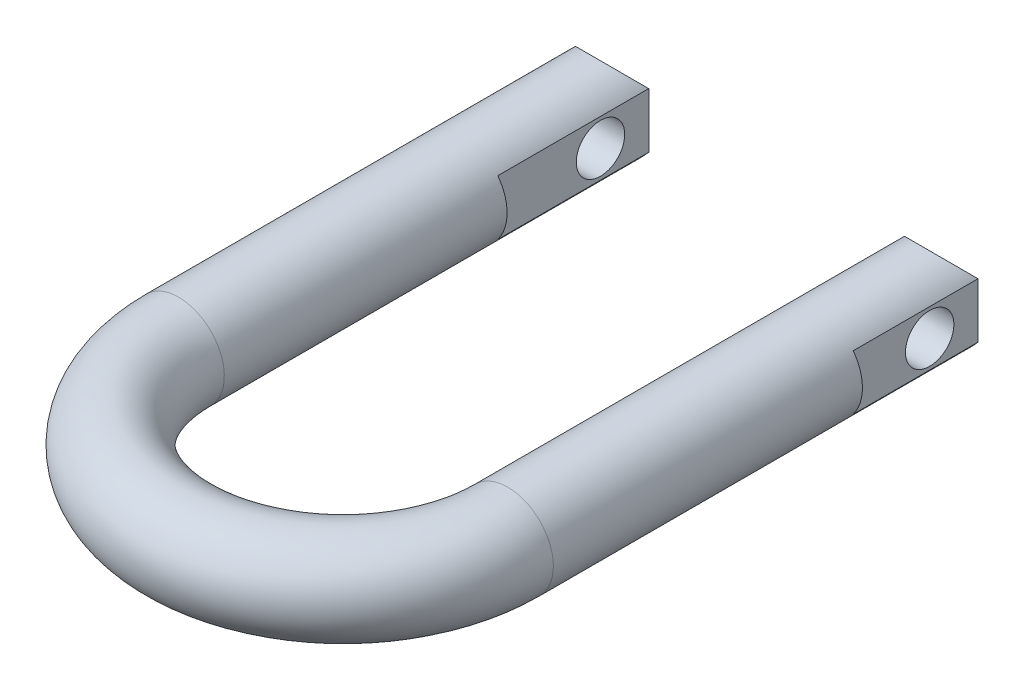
ISO-10303-21;
HEADER;
FILE_DESCRIPTION(('STEP AP214'),'2;1');
FILE_NAME('part.step','',(''),(''),'','','');
FILE_SCHEMA(('AUTOMOTIVE_DESIGN { 1 0 10303 214 1 1 1 1 }'));
ENDSEC;
DATA;
#1=APPLICATION_CONTEXT('core data for automotive mechanical design processes');
#2=APPLICATION_PROTOCOL_DEFINITION('international standard','automotive_design',2000,#1);
#3=PRODUCT_CONTEXT('',#1,'mechanical');
#4=PRODUCT('Part','Part','',(#3));
#5=PRODUCT_RELATED_PRODUCT_CATEGORY('part','',(#4));
#6=PRODUCT_DEFINITION_FORMATION('','',#4);
#7=PRODUCT_DEFINITION_CONTEXT('part definition',#1,'design');
#8=PRODUCT_DEFINITION('design','',#6,#7);
#9=PRODUCT_DEFINITION_SHAPE('','',#8);
#10=(LENGTH_UNIT() NAMED_UNIT(*) SI_UNIT(.MILLI.,.METRE.));
#11=(NAMED_UNIT(*) PLANE_ANGLE_UNIT() SI_UNIT($,.RADIAN.));
#12=(NAMED_UNIT(*) SI_UNIT($,.STERADIAN.) SOLID_ANGLE_UNIT());
#13=UNCERTAINTY_MEASURE_WITH_UNIT(LENGTH_MEASURE(1.E-05),#10,'distance_accuracy_value','');
#14=(GEOMETRIC_REPRESENTATION_CONTEXT(3) GLOBAL_UNCERTAINTY_ASSIGNED_CONTEXT((#13)) GLOBAL_UNIT_ASSIGNED_CONTEXT((#10,
#11,#12)) REPRESENTATION_CONTEXT('',''));
#15=CARTESIAN_POINT('',(0.,0.,0.));
#16=DIRECTION('',(0.,0.,1.));
#17=DIRECTION('',(1.,0.,0.));
#18=AXIS2_PLACEMENT_3D('',#15,#16,#17);
#19=CARTESIAN_POINT('',(97.3,-13.9,37.));
#20=DIRECTION('',(-1.,0.,0.));
#21=DIRECTION('',(0.,-1.,0.));
#22=AXIS2_PLACEMENT_3D('',#19,#20,#21);
#23=PLANE('',#22);
#24=DIRECTION('',(0.,0.,-1.));
#25=VECTOR('',#24,1.);
#26=CARTESIAN_POINT('',(97.3,-13.2999060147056,186.6));
#27=LINE('',#26,#25);
#28=CARTESIAN_POINT('',(97.3,-13.2999060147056,37.));
#29=VERTEX_POINT('',#28);
#30=CARTESIAN_POINT('',(97.3,-13.2999060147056,-23.4));
#31=VERTEX_POINT('',#30);
#32=EDGE_CURVE('E127',#29,#31,#27,.T.);
#33=ORIENTED_EDGE('',*,*,#32,.T.);
#34=DIRECTION('',(0.,1.,0.));
#35=VECTOR('',#34,1.);
#36=CARTESIAN_POINT('',(97.3,-13.9,-23.4));
#37=LINE('',#36,#35);
#38=CARTESIAN_POINT('',(97.3,13.2999060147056,-23.4));
#39=VERTEX_POINT('',#38);
#40=EDGE_CURVE('E141',#31,#39,#37,.T.);
#41=ORIENTED_EDGE('',*,*,#40,.T.);
#42=DIRECTION('',(0.,0.,-1.));
#43=VECTOR('',#42,1.);
#44=CARTESIAN_POINT('',(97.3,13.2999060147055,186.6));
#45=LINE('',#44,#43);
#46=CARTESIAN_POINT('',(97.3,13.2999060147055,37.));
#47=VERTEX_POINT('',#46);
#48=EDGE_CURVE('E116',#39,#47,#45,.F.);
#49=ORIENTED_EDGE('',*,*,#48,.T.);
#50=DIRECTION('',(0.,1.,0.));
#51=VECTOR('',#50,1.);
#52=CARTESIAN_POINT('',(97.3,-13.9,37.));
#53=LINE('',#52,#51);
#54=EDGE_CURVE('E147',#29,#47,#53,.T.);
#55=ORIENTED_EDGE('',*,*,#54,.F.);
#56=EDGE_LOOP('',(#33,#41,#49,#55));
#57=FACE_BOUND('',#56,.T.);
#58=CARTESIAN_POINT('',(97.3,0.,0.));
#59=DIRECTION('',(-1.,0.,0.));
#60=DIRECTION('',(0.,0.,1.));
#61=AXIS2_PLACEMENT_3D('',#58,#59,#60);
#62=CIRCLE('',#61,11.72);
#63=CARTESIAN_POINT('',(97.3,0.,11.72));
#64=VERTEX_POINT('',#63);
#65=EDGE_CURVE('E506',#64,#64,#62,.T.);
#66=ORIENTED_EDGE('',*,*,#65,.T.);
#67=EDGE_LOOP('',(#66));
#68=FACE_BOUND('',#67,.T.);
#69=ADVANCED_FACE('F14',(#57,#68),#23,.F.);
#70=CARTESIAN_POINT('',(79.65,0.,186.6));
#71=DIRECTION('',(0.,0.,-1.));
#72=DIRECTION('',(1.,0.,0.));
#73=AXIS2_PLACEMENT_3D('',#70,#71,#72);
#74=CYLINDRICAL_SURFACE('',#73,22.1);
#75=CARTESIAN_POINT('',(79.65,0.,186.6));
#76=DIRECTION('',(0.,0.,-1.));
#77=DIRECTION('',(0.,-1.,0.));
#78=AXIS2_PLACEMENT_3D('',#75,#76,#77);
#79=CIRCLE('',#78,22.1);
#80=CARTESIAN_POINT('',(101.75,0.,186.6));
#81=VERTEX_POINT('',#80);
#82=EDGE_CURVE('E157',#81,#81,#79,.T.);
#83=ORIENTED_EDGE('',*,*,#82,.T.);
#84=EDGE_LOOP('',(#83));
#85=FACE_BOUND('',#84,.T.);
#86=ORIENTED_EDGE('',*,*,#48,.F.);
#87=CARTESIAN_POINT('',(79.65,0.,-36.6999060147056));
#88=DIRECTION('',(0.,0.707106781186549,-0.707106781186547));
#89=DIRECTION('',(0.,-0.707106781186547,-0.707106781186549));
#90=AXIS2_PLACEMENT_3D('',#87,#88,#89);
#91=ELLIPSE('',#90,31.2541197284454,22.1);
#92=CARTESIAN_POINT('',(62.1,13.4315859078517,-23.2683201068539));
#93=VERTEX_POINT('',#92);
#94=EDGE_CURVE('E120',#39,#93,#91,.F.);
#95=ORIENTED_EDGE('',*,*,#94,.T.);
#96=DIRECTION('',(0.,0.,-1.));
#97=VECTOR('',#96,1.);
#98=CARTESIAN_POINT('',(62.1,13.4315859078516,186.6));
#99=LINE('',#98,#97);
#100=CARTESIAN_POINT('',(62.1,13.4315859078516,-23.4));
#101=VERTEX_POINT('',#100);
#102=EDGE_CURVE('E135',#101,#93,#99,.F.);
#103=ORIENTED_EDGE('',*,*,#102,.F.);
#104=CARTESIAN_POINT('',(79.65,0.,-23.4));
#105=DIRECTION('',(0.,0.,-1.));
#106=DIRECTION('',(0.,-1.,0.));
#107=AXIS2_PLACEMENT_3D('',#104,#105,#106);
#108=CIRCLE('',#107,22.1);
#109=CARTESIAN_POINT('',(62.05,13.3660016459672,-23.4));
#110=VERTEX_POINT('',#109);
#111=EDGE_CURVE('E126',#110,#101,#108,.T.);
#112=ORIENTED_EDGE('',*,*,#111,.F.);
#113=DIRECTION('',(0.,0.,-1.));
#114=VECTOR('',#113,1.);
#115=CARTESIAN_POINT('',(62.05,13.3660016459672,186.6));
#116=LINE('',#115,#114);
#117=CARTESIAN_POINT('',(62.05,13.3660016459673,49.7));
#118=VERTEX_POINT('',#117);
#119=EDGE_CURVE('E150',#110,#118,#116,.F.);
#120=ORIENTED_EDGE('',*,*,#119,.T.);
#121=CARTESIAN_POINT('',(79.65,0.,49.7));
#122=DIRECTION('',(0.,0.,1.));
#123=DIRECTION('',(0.,-1.,0.));
#124=AXIS2_PLACEMENT_3D('',#121,#122,#123);
#125=CIRCLE('',#124,22.1);
#126=CARTESIAN_POINT('',(62.05,-13.3660016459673,49.7));
#127=VERTEX_POINT('',#126);
#128=EDGE_CURVE('E9',#127,#118,#125,.F.);
#129=ORIENTED_EDGE('',*,*,#128,.F.);
#130=DIRECTION('',(0.,0.,-1.));
#131=VECTOR('',#130,1.);
#132=CARTESIAN_POINT('',(62.05,-13.3660016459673,186.6));
#133=LINE('',#132,#131);
#134=CARTESIAN_POINT('',(62.05,-13.3660016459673,-23.4));
#135=VERTEX_POINT('',#134);
#136=EDGE_CURVE('E370',#127,#135,#133,.T.);
#137=ORIENTED_EDGE('',*,*,#136,.T.);
#138=CARTESIAN_POINT('',(62.1,-13.4315859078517,-23.4));
#139=VERTEX_POINT('',#138);
#140=EDGE_CURVE('E155',#139,#135,#108,.T.);
#141=ORIENTED_EDGE('',*,*,#140,.F.);
#142=DIRECTION('',(0.,0.,-1.));
#143=VECTOR('',#142,1.);
#144=CARTESIAN_POINT('',(62.1,-13.4315859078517,186.6));
#145=LINE('',#144,#143);
#146=CARTESIAN_POINT('',(62.1,-13.4315859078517,-23.2683201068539));
#147=VERTEX_POINT('',#146);
#148=EDGE_CURVE('E38',#139,#147,#145,.F.);
#149=ORIENTED_EDGE('',*,*,#148,.T.);
#150=CARTESIAN_POINT('',(79.65,0.,-36.6999060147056));
#151=DIRECTION('',(0.,0.707106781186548,0.707106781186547));
#152=DIRECTION('',(0.,0.707106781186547,-0.707106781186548));
#153=AXIS2_PLACEMENT_3D('',#150,#151,#152);
#154=ELLIPSE('',#153,31.2541197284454,22.1);
#155=EDGE_CURVE('E363',#31,#147,#154,.F.);
#156=ORIENTED_EDGE('',*,*,#155,.F.);
#157=ORIENTED_EDGE('',*,*,#32,.F.);
#158=CARTESIAN_POINT('',(79.65,0.,37.));
#159=DIRECTION('',(0.,0.,-1.));
#160=DIRECTION('',(0.,1.,0.));
#161=AXIS2_PLACEMENT_3D('',#158,#159,#160);
#162=CIRCLE('',#161,22.1);
#163=EDGE_CURVE('E23',#29,#47,#162,.F.);
#164=ORIENTED_EDGE('',*,*,#163,.T.);
#165=EDGE_LOOP('',(#86,#95,#103,#112,#120,#129,#137,#141,#149,#156,#157,#164));
#166=FACE_BOUND('',#165,.T.);
#167=ADVANCED_FACE('F118',(#85,#166),#74,.T.);
#168=CARTESIAN_POINT('',(79.65,0.,-23.4));
#169=DIRECTION('',(0.,0.,-1.));
#170=DIRECTION('',(0.,1.,0.));
#171=AXIS2_PLACEMENT_3D('',#168,#169,#170);
#172=PLANE('',#171);
#173=DIRECTION('',(0.,1.,0.));
#174=VECTOR('',#173,1.);
#175=CARTESIAN_POINT('',(62.1,13.2999060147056,-23.4));
#176=LINE('',#175,#174);
#177=CARTESIAN_POINT('',(62.1,13.2999060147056,-23.4));
#178=VERTEX_POINT('',#177);
#179=EDGE_CURVE('E143',#178,#101,#176,.T.);
#180=ORIENTED_EDGE('',*,*,#179,.F.);
#181=DIRECTION('',(1.,0.,0.));
#182=VECTOR('',#181,1.);
#183=CARTESIAN_POINT('',(62.1,13.2999060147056,-23.4));
#184=LINE('',#183,#182);
#185=EDGE_CURVE('E132',#178,#39,#184,.T.);
#186=ORIENTED_EDGE('',*,*,#185,.T.);
#187=ORIENTED_EDGE('',*,*,#40,.F.);
#188=DIRECTION('',(1.,0.,0.));
#189=VECTOR('',#188,1.);
#190=CARTESIAN_POINT('',(62.1,-13.2999060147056,-23.4));
#191=LINE('',#190,#189);
#192=CARTESIAN_POINT('',(62.1,-13.2999060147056,-23.4));
#193=VERTEX_POINT('',#192);
#194=EDGE_CURVE('E360',#193,#31,#191,.T.);
#195=ORIENTED_EDGE('',*,*,#194,.F.);
#196=DIRECTION('',(0.,-1.,0.));
#197=VECTOR('',#196,1.);
#198=CARTESIAN_POINT('',(62.1,-13.2999060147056,-23.4));
#199=LINE('',#198,#197);
#200=EDGE_CURVE('E134',#193,#139,#199,.T.);
#201=ORIENTED_EDGE('',*,*,#200,.T.);
#202=ORIENTED_EDGE('',*,*,#140,.T.);
#203=DIRECTION('',(0.,1.,0.));
#204=VECTOR('',#203,1.);
#205=CARTESIAN_POINT('',(62.05,-13.9,-23.4));
#206=LINE('',#205,#204);
#207=EDGE_CURVE('E365',#135,#110,#206,.T.);
#208=ORIENTED_EDGE('',*,*,#207,.T.);
#209=ORIENTED_EDGE('',*,*,#111,.T.);
#210=EDGE_LOOP('',(#180,#186,#187,#195,#201,#202,#208,#209));
#211=FACE_BOUND('',#210,.T.);
#212=ADVANCED_FACE('F139',(#211),#172,.T.);
#213=CARTESIAN_POINT('',(62.05,13.9,-23.4));
#214=DIRECTION('',(-1.,0.,0.));
#215=DIRECTION('',(0.,-1.,0.));
#216=AXIS2_PLACEMENT_3D('',#213,#214,#215);
#217=PLANE('',#216);
#218=ORIENTED_EDGE('',*,*,#207,.F.);
#219=ORIENTED_EDGE('',*,*,#136,.F.);
#220=DIRECTION('',(0.,1.,0.));
#221=VECTOR('',#220,1.);
#222=CARTESIAN_POINT('',(62.05,-13.9,49.7));
#223=LINE('',#222,#221);
#224=EDGE_CURVE('E368',#127,#118,#223,.T.);
#225=ORIENTED_EDGE('',*,*,#224,.T.);
#226=ORIENTED_EDGE('',*,*,#119,.F.);
#227=EDGE_LOOP('',(#218,#219,#225,#226));
#228=FACE_BOUND('',#227,.T.);
#229=CARTESIAN_POINT('',(62.05,0.,0.));
#230=DIRECTION('',(-1.,0.,0.));
#231=DIRECTION('',(0.,-1.,0.));
#232=AXIS2_PLACEMENT_3D('',#229,#230,#231);
#233=CIRCLE('',#232,11.72);
#234=CARTESIAN_POINT('',(62.05,-11.72,0.));
#235=VERTEX_POINT('',#234);
#236=EDGE_CURVE('E18',#235,#235,#233,.F.);
#237=ORIENTED_EDGE('',*,*,#236,.T.);
#238=EDGE_LOOP('',(#237));
#239=FACE_BOUND('',#238,.T.);
#240=ADVANCED_FACE('F262',(#228,#239),#217,.T.);
#241=CARTESIAN_POINT('',(-97.3,13.9,37.));
#242=DIRECTION('',(-1.,0.,0.));
#243=DIRECTION('',(0.,-1.,0.));
#244=AXIS2_PLACEMENT_3D('',#241,#242,#243);
#245=PLANE('',#244);
#246=DIRECTION('',(0.,0.,-1.));
#247=VECTOR('',#246,1.);
#248=CARTESIAN_POINT('',(-97.3,-13.2999060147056,186.6));
#249=LINE('',#248,#247);
#250=CARTESIAN_POINT('',(-97.3,-13.2999060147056,-23.4));
#251=VERTEX_POINT('',#250);
#252=CARTESIAN_POINT('',(-97.3,-13.2999060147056,37.));
#253=VERTEX_POINT('',#252);
#254=EDGE_CURVE('E203',#251,#253,#249,.F.);
#255=ORIENTED_EDGE('',*,*,#254,.T.);
#256=DIRECTION('',(0.,1.,0.));
#257=VECTOR('',#256,1.);
#258=CARTESIAN_POINT('',(-97.3,-13.9,37.));
#259=LINE('',#258,#257);
#260=CARTESIAN_POINT('',(-97.3,13.2999060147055,37.));
#261=VERTEX_POINT('',#260);
#262=EDGE_CURVE('E199',#253,#261,#259,.T.);
#263=ORIENTED_EDGE('',*,*,#262,.T.);
#264=DIRECTION('',(0.,0.,-1.));
#265=VECTOR('',#264,1.);
#266=CARTESIAN_POINT('',(-97.3,13.2999060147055,186.6));
#267=LINE('',#266,#265);
#268=CARTESIAN_POINT('',(-97.3,13.2999060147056,-23.4));
#269=VERTEX_POINT('',#268);
#270=EDGE_CURVE('E207',#261,#269,#267,.T.);
#271=ORIENTED_EDGE('',*,*,#270,.T.);
#272=DIRECTION('',(0.,1.,0.));
#273=VECTOR('',#272,1.);
#274=CARTESIAN_POINT('',(-97.3,-13.9,-23.4));
#275=LINE('',#274,#273);
#276=EDGE_CURVE('E200',#251,#269,#275,.T.);
#277=ORIENTED_EDGE('',*,*,#276,.F.);
#278=EDGE_LOOP('',(#255,#263,#271,#277));
#279=FACE_BOUND('',#278,.T.);
#280=CARTESIAN_POINT('',(-97.3,0.,0.));
#281=DIRECTION('',(1.,0.,0.));
#282=DIRECTION('',(0.,0.,-1.));
#283=AXIS2_PLACEMENT_3D('',#280,#281,#282);
#284=CIRCLE('',#283,11.72);
#285=CARTESIAN_POINT('',(-97.3,0.,-11.72));
#286=VERTEX_POINT('',#285);
#287=EDGE_CURVE('E507',#286,#286,#284,.F.);
#288=ORIENTED_EDGE('',*,*,#287,.F.);
#289=EDGE_LOOP('',(#288));
#290=FACE_BOUND('',#289,.T.);
#291=ADVANCED_FACE('F298',(#279,#290),#245,.T.);
#292=CARTESIAN_POINT('',(-79.65,0.,186.6));
#293=DIRECTION('',(0.,0.,-1.));
#294=DIRECTION('',(1.,0.,0.));
#295=AXIS2_PLACEMENT_3D('',#292,#293,#294);
#296=CYLINDRICAL_SURFACE('',#295,22.1);
#297=CARTESIAN_POINT('',(-79.65,0.,186.6));
#298=DIRECTION('',(0.,0.,1.));
#299=DIRECTION('',(0.,-1.,0.));
#300=AXIS2_PLACEMENT_3D('',#297,#298,#299);
#301=CIRCLE('',#300,22.1);
#302=CARTESIAN_POINT('',(-101.75,0.,186.6));
#303=VERTEX_POINT('',#302);
#304=EDGE_CURVE('E212',#303,#303,#301,.T.);
#305=ORIENTED_EDGE('',*,*,#304,.F.);
#306=EDGE_LOOP('',(#305));
#307=FACE_BOUND('',#306,.T.);
#308=CARTESIAN_POINT('',(-79.65,0.,-36.6999060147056));
#309=DIRECTION('',(0.,-0.707106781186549,0.707106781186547));
#310=DIRECTION('',(0.,-0.707106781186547,-0.707106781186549));
#311=AXIS2_PLACEMENT_3D('',#308,#309,#310);
#312=ELLIPSE('',#311,31.2541197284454,22.1);
#313=CARTESIAN_POINT('',(-62.1,13.4315859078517,-23.2683201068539));
#314=VERTEX_POINT('',#313);
#315=EDGE_CURVE('E171',#314,#269,#312,.T.);
#316=ORIENTED_EDGE('',*,*,#315,.T.);
#317=ORIENTED_EDGE('',*,*,#270,.F.);
#318=CARTESIAN_POINT('',(-79.65,0.,37.));
#319=DIRECTION('',(0.,0.,1.));
#320=DIRECTION('',(0.,-1.,0.));
#321=AXIS2_PLACEMENT_3D('',#318,#319,#320);
#322=CIRCLE('',#321,22.1);
#323=EDGE_CURVE('E215',#261,#253,#322,.T.);
#324=ORIENTED_EDGE('',*,*,#323,.T.);
#325=ORIENTED_EDGE('',*,*,#254,.F.);
#326=CARTESIAN_POINT('',(-79.65,0.,-36.6999060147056));
#327=DIRECTION('',(0.,-0.707106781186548,-0.707106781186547));
#328=DIRECTION('',(0.,0.707106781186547,-0.707106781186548));
#329=AXIS2_PLACEMENT_3D('',#326,#327,#328);
#330=ELLIPSE('',#329,31.2541197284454,22.1);
#331=CARTESIAN_POINT('',(-62.1,-13.4315859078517,-23.2683201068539));
#332=VERTEX_POINT('',#331);
#333=EDGE_CURVE('E185',#332,#251,#330,.T.);
#334=ORIENTED_EDGE('',*,*,#333,.F.);
#335=DIRECTION('',(0.,0.,-1.));
#336=VECTOR('',#335,1.);
#337=CARTESIAN_POINT('',(-62.1,-13.4315859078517,186.6));
#338=LINE('',#337,#336);
#339=CARTESIAN_POINT('',(-62.1,-13.4315859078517,-23.4));
#340=VERTEX_POINT('',#339);
#341=EDGE_CURVE('E182',#332,#340,#338,.T.);
#342=ORIENTED_EDGE('',*,*,#341,.T.);
#343=CARTESIAN_POINT('',(-79.65,0.,-23.4));
#344=DIRECTION('',(0.,0.,1.));
#345=DIRECTION('',(0.,-1.,0.));
#346=AXIS2_PLACEMENT_3D('',#343,#344,#345);
#347=CIRCLE('',#346,22.1);
#348=CARTESIAN_POINT('',(-62.05,-13.3660016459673,-23.4));
#349=VERTEX_POINT('',#348);
#350=EDGE_CURVE('E210',#340,#349,#347,.T.);
#351=ORIENTED_EDGE('',*,*,#350,.T.);
#352=DIRECTION('',(0.,0.,-1.));
#353=VECTOR('',#352,1.);
#354=CARTESIAN_POINT('',(-62.05,-13.3660016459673,186.6));
#355=LINE('',#354,#353);
#356=CARTESIAN_POINT('',(-62.05,-13.3660016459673,49.7));
#357=VERTEX_POINT('',#356);
#358=EDGE_CURVE('E190',#349,#357,#355,.F.);
#359=ORIENTED_EDGE('',*,*,#358,.T.);
#360=CARTESIAN_POINT('',(-79.65,0.,49.7));
#361=DIRECTION('',(0.,0.,-1.));
#362=DIRECTION('',(0.,1.,0.));
#363=AXIS2_PLACEMENT_3D('',#360,#361,#362);
#364=CIRCLE('',#363,22.1);
#365=CARTESIAN_POINT('',(-62.05,13.3660016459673,49.7));
#366=VERTEX_POINT('',#365);
#367=EDGE_CURVE('E218',#366,#357,#364,.T.);
#368=ORIENTED_EDGE('',*,*,#367,.F.);
#369=DIRECTION('',(0.,0.,-1.));
#370=VECTOR('',#369,1.);
#371=CARTESIAN_POINT('',(-62.05,13.3660016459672,186.6));
#372=LINE('',#371,#370);
#373=CARTESIAN_POINT('',(-62.05,13.3660016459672,-23.4));
#374=VERTEX_POINT('',#373);
#375=EDGE_CURVE('E196',#366,#374,#372,.T.);
#376=ORIENTED_EDGE('',*,*,#375,.T.);
#377=CARTESIAN_POINT('',(-62.1,13.4315859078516,-23.4));
#378=VERTEX_POINT('',#377);
#379=EDGE_CURVE('E209',#374,#378,#347,.T.);
#380=ORIENTED_EDGE('',*,*,#379,.T.);
#381=DIRECTION('',(0.,0.,-1.));
#382=VECTOR('',#381,1.);
#383=CARTESIAN_POINT('',(-62.1,13.4315859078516,186.6));
#384=LINE('',#383,#382);
#385=EDGE_CURVE('E169',#314,#378,#384,.T.);
#386=ORIENTED_EDGE('',*,*,#385,.F.);
#387=EDGE_LOOP('',(#316,#317,#324,#325,#334,#342,#351,#359,#368,#376,#380,#386));
#388=FACE_BOUND('',#387,.T.);
#389=ADVANCED_FACE('F287',(#307,#388),#296,.T.);
#390=CARTESIAN_POINT('',(-79.65,0.,-23.4));
#391=DIRECTION('',(0.,0.,1.));
#392=DIRECTION('',(0.,-1.,0.));
#393=AXIS2_PLACEMENT_3D('',#390,#391,#392);
#394=PLANE('',#393);
#395=ORIENTED_EDGE('',*,*,#276,.T.);
#396=DIRECTION('',(-1.,0.,0.));
#397=VECTOR('',#396,1.);
#398=CARTESIAN_POINT('',(-62.1,13.2999060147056,-23.4));
#399=LINE('',#398,#397);
#400=CARTESIAN_POINT('',(-62.1,13.2999060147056,-23.4));
#401=VERTEX_POINT('',#400);
#402=EDGE_CURVE('E164',#401,#269,#399,.T.);
#403=ORIENTED_EDGE('',*,*,#402,.F.);
#404=DIRECTION('',(0.,1.,0.));
#405=VECTOR('',#404,1.);
#406=CARTESIAN_POINT('',(-62.1,13.2999060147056,-23.4));
#407=LINE('',#406,#405);
#408=EDGE_CURVE('E161',#401,#378,#407,.T.);
#409=ORIENTED_EDGE('',*,*,#408,.T.);
#410=ORIENTED_EDGE('',*,*,#379,.F.);
#411=DIRECTION('',(0.,1.,0.));
#412=VECTOR('',#411,1.);
#413=CARTESIAN_POINT('',(-62.05,-13.9,-23.4));
#414=LINE('',#413,#412);
#415=EDGE_CURVE('E188',#349,#374,#414,.T.);
#416=ORIENTED_EDGE('',*,*,#415,.F.);
#417=ORIENTED_EDGE('',*,*,#350,.F.);
#418=DIRECTION('',(0.,-1.,0.));
#419=VECTOR('',#418,1.);
#420=CARTESIAN_POINT('',(-62.1,-13.2999060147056,-23.4));
#421=LINE('',#420,#419);
#422=CARTESIAN_POINT('',(-62.1,-13.2999060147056,-23.4));
#423=VERTEX_POINT('',#422);
#424=EDGE_CURVE('E175',#423,#340,#421,.T.);
#425=ORIENTED_EDGE('',*,*,#424,.F.);
#426=DIRECTION('',(-1.,0.,0.));
#427=VECTOR('',#426,1.);
#428=CARTESIAN_POINT('',(-62.1,-13.2999060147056,-23.4));
#429=LINE('',#428,#427);
#430=EDGE_CURVE('E177',#423,#251,#429,.T.);
#431=ORIENTED_EDGE('',*,*,#430,.T.);
#432=EDGE_LOOP('',(#395,#403,#409,#410,#416,#417,#425,#431));
#433=FACE_BOUND('',#432,.T.);
#434=ADVANCED_FACE('F282',(#433),#394,.F.);
#435=CARTESIAN_POINT('',(0.,0.,186.6));
#436=DIRECTION('',(0.,1.,0.));
#437=DIRECTION('',(-1.,0.,0.));
#438=AXIS2_PLACEMENT_3D('',#435,#436,#437);
#439=TOROIDAL_SURFACE('',#438,79.65,22.1);
#440=CARTESIAN_POINT('',(0.,0.,186.6));
#441=DIRECTION('',(0.,1.,0.));
#442=DIRECTION('',(-1.,0.,0.));
#443=AXIS2_PLACEMENT_3D('',#440,#441,#442);
#444=CIRCLE('',#443,101.75);
#445=EDGE_CURVE('',#303,#81,#444,.T.);
#446=ORIENTED_EDGE('',*,*,#304,.T.);
#447=ORIENTED_EDGE('',*,*,#82,.F.);
#448=ORIENTED_EDGE('',*,*,#445,.T.);
#449=ORIENTED_EDGE('',*,*,#445,.F.);
#450=EDGE_LOOP('',(#446,#448,#447,#449));
#451=FACE_BOUND('',#450,.T.);
#452=ADVANCED_FACE('F16',(#451),#439,.T.);
#453=CARTESIAN_POINT('',(-97.3,-13.9,37.));
#454=DIRECTION('',(0.,0.,1.));
#455=DIRECTION('',(0.,-1.,0.));
#456=AXIS2_PLACEMENT_3D('',#453,#454,#455);
#457=PLANE('',#456);
#458=ORIENTED_EDGE('',*,*,#262,.F.);
#459=ORIENTED_EDGE('',*,*,#323,.F.);
#460=EDGE_LOOP('',(#458,#459));
#461=FACE_BOUND('',#460,.T.);
#462=ADVANCED_FACE('F302',(#461),#457,.F.);
#463=CARTESIAN_POINT('',(-62.05,-13.9,49.7));
#464=DIRECTION('',(0.,0.,-1.));
#465=DIRECTION('',(0.,1.,0.));
#466=AXIS2_PLACEMENT_3D('',#463,#464,#465);
#467=PLANE('',#466);
#468=DIRECTION('',(0.,1.,0.));
#469=VECTOR('',#468,1.);
#470=CARTESIAN_POINT('',(-62.05,-13.9,49.7));
#471=LINE('',#470,#469);
#472=EDGE_CURVE('E191',#357,#366,#471,.T.);
#473=ORIENTED_EDGE('',*,*,#472,.T.);
#474=ORIENTED_EDGE('',*,*,#367,.T.);
#475=EDGE_LOOP('',(#473,#474));
#476=FACE_BOUND('',#475,.T.);
#477=ADVANCED_FACE('F241',(#476),#467,.T.);
#478=CARTESIAN_POINT('',(-62.05,13.9,49.7));
#479=DIRECTION('',(-1.,0.,0.));
#480=DIRECTION('',(0.,-1.,0.));
#481=AXIS2_PLACEMENT_3D('',#478,#479,#480);
#482=PLANE('',#481);
#483=CARTESIAN_POINT('',(-62.05,0.,0.));
#484=DIRECTION('',(-1.,0.,0.));
#485=DIRECTION('',(0.,-1.,0.));
#486=AXIS2_PLACEMENT_3D('',#483,#484,#485);
#487=CIRCLE('',#486,11.72);
#488=CARTESIAN_POINT('',(-62.05,-11.72,0.));
#489=VERTEX_POINT('',#488);
#490=EDGE_CURVE('E187',#489,#489,#487,.T.);
#491=ORIENTED_EDGE('',*,*,#490,.T.);
#492=EDGE_LOOP('',(#491));
#493=FACE_BOUND('',#492,.T.);
#494=ORIENTED_EDGE('',*,*,#472,.F.);
#495=ORIENTED_EDGE('',*,*,#358,.F.);
#496=ORIENTED_EDGE('',*,*,#415,.T.);
#497=ORIENTED_EDGE('',*,*,#375,.F.);
#498=EDGE_LOOP('',(#494,#495,#496,#497));
#499=FACE_BOUND('',#498,.T.);
#500=ADVANCED_FACE('F224',(#493,#499),#482,.F.);
#501=CARTESIAN_POINT('',(-61.9,0.,0.));
#502=DIRECTION('',(-1.,0.,0.));
#503=DIRECTION('',(0.,-1.,0.));
#504=AXIS2_PLACEMENT_3D('',#501,#502,#503);
#505=CYLINDRICAL_SURFACE('',#504,11.72);
#506=ORIENTED_EDGE('',*,*,#287,.T.);
#507=EDGE_LOOP('',(#506));
#508=FACE_BOUND('',#507,.T.);
#509=ORIENTED_EDGE('',*,*,#490,.F.);
#510=EDGE_LOOP('',(#509));
#511=FACE_BOUND('',#510,.T.);
#512=ADVANCED_FACE('F227',(#508,#511),#505,.F.);
#513=CARTESIAN_POINT('',(-62.1,-13.2999060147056,-23.4));
#514=DIRECTION('',(0.,-0.707106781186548,-0.707106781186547));
#515=DIRECTION('',(0.,0.707106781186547,-0.707106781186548));
#516=AXIS2_PLACEMENT_3D('',#513,#514,#515);
#517=PLANE('',#516);
#518=ORIENTED_EDGE('',*,*,#333,.T.);
#519=ORIENTED_EDGE('',*,*,#430,.F.);
#520=DIRECTION('',(0.,-0.707106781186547,0.707106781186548));
#521=VECTOR('',#520,1.);
#522=CARTESIAN_POINT('',(-62.1,-13.2999060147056,-23.4));
#523=LINE('',#522,#521);
#524=EDGE_CURVE('E174',#423,#332,#523,.T.);
#525=ORIENTED_EDGE('',*,*,#524,.T.);
#526=EDGE_LOOP('',(#518,#519,#525));
#527=FACE_BOUND('',#526,.T.);
#528=ADVANCED_FACE('F229',(#527),#517,.T.);
#529=CARTESIAN_POINT('',(-62.1,-22.1,-23.4));
#530=DIRECTION('',(1.,0.,0.));
#531=DIRECTION('',(0.,1.,0.));
#532=AXIS2_PLACEMENT_3D('',#529,#530,#531);
#533=PLANE('',#532);
#534=ORIENTED_EDGE('',*,*,#524,.F.);
#535=ORIENTED_EDGE('',*,*,#424,.T.);
#536=ORIENTED_EDGE('',*,*,#341,.F.);
#537=EDGE_LOOP('',(#534,#535,#536));
#538=FACE_BOUND('',#537,.T.);
#539=ADVANCED_FACE('F238',(#538),#533,.F.);
#540=CARTESIAN_POINT('',(-62.1,13.2999060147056,-23.4));
#541=DIRECTION('',(0.,-0.707106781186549,0.707106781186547));
#542=DIRECTION('',(0.,-0.707106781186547,-0.707106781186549));
#543=AXIS2_PLACEMENT_3D('',#540,#541,#542);
#544=PLANE('',#543);
#545=DIRECTION('',(0.,0.707106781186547,0.707106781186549));
#546=VECTOR('',#545,1.);
#547=CARTESIAN_POINT('',(-62.1,13.2999060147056,-23.4));
#548=LINE('',#547,#546);
#549=EDGE_CURVE('E160',#401,#314,#548,.T.);
#550=ORIENTED_EDGE('',*,*,#549,.F.);
#551=ORIENTED_EDGE('',*,*,#402,.T.);
#552=ORIENTED_EDGE('',*,*,#315,.F.);
#553=EDGE_LOOP('',(#550,#551,#552));
#554=FACE_BOUND('',#553,.T.);
#555=ADVANCED_FACE('F266',(#554),#544,.F.);
#556=CARTESIAN_POINT('',(-62.1,13.2999060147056,-23.4));
#557=DIRECTION('',(-1.,0.,0.));
#558=DIRECTION('',(0.,-1.,0.));
#559=AXIS2_PLACEMENT_3D('',#556,#557,#558);
#560=PLANE('',#559);
#561=ORIENTED_EDGE('',*,*,#385,.T.);
#562=ORIENTED_EDGE('',*,*,#408,.F.);
#563=ORIENTED_EDGE('',*,*,#549,.T.);
#564=EDGE_LOOP('',(#561,#562,#563));
#565=FACE_BOUND('',#564,.T.);
#566=ADVANCED_FACE('F259',(#565),#560,.T.);
#567=CARTESIAN_POINT('',(97.3,-13.9,37.));
#568=DIRECTION('',(0.,0.,-1.));
#569=DIRECTION('',(0.,1.,0.));
#570=AXIS2_PLACEMENT_3D('',#567,#568,#569);
#571=PLANE('',#570);
#572=ORIENTED_EDGE('',*,*,#54,.T.);
#573=ORIENTED_EDGE('',*,*,#163,.F.);
#574=EDGE_LOOP('',(#572,#573));
#575=FACE_BOUND('',#574,.T.);
#576=ADVANCED_FACE('F256',(#575),#571,.T.);
#577=CARTESIAN_POINT('',(62.05,-13.9,49.7));
#578=DIRECTION('',(0.,0.,1.));
#579=DIRECTION('',(0.,-1.,0.));
#580=AXIS2_PLACEMENT_3D('',#577,#578,#579);
#581=PLANE('',#580);
#582=ORIENTED_EDGE('',*,*,#224,.F.);
#583=ORIENTED_EDGE('',*,*,#128,.T.);
#584=EDGE_LOOP('',(#582,#583));
#585=FACE_BOUND('',#584,.T.);
#586=ADVANCED_FACE('F254',(#585),#581,.F.);
#587=CARTESIAN_POINT('',(61.9,0.,0.));
#588=DIRECTION('',(1.,0.,0.));
#589=DIRECTION('',(0.,1.,0.));
#590=AXIS2_PLACEMENT_3D('',#587,#588,#589);
#591=CYLINDRICAL_SURFACE('',#590,11.72);
#592=ORIENTED_EDGE('',*,*,#236,.F.);
#593=EDGE_LOOP('',(#592));
#594=FACE_BOUND('',#593,.T.);
#595=ORIENTED_EDGE('',*,*,#65,.F.);
#596=EDGE_LOOP('',(#595));
#597=FACE_BOUND('',#596,.T.);
#598=ADVANCED_FACE('F335',(#594,#597),#591,.F.);
#599=CARTESIAN_POINT('',(62.1,-13.2999060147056,-23.4));
#600=DIRECTION('',(0.,0.707106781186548,0.707106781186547));
#601=DIRECTION('',(0.,-0.707106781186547,0.707106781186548));
#602=AXIS2_PLACEMENT_3D('',#599,#600,#601);
#603=PLANE('',#602);
#604=ORIENTED_EDGE('',*,*,#155,.T.);
#605=DIRECTION('',(0.,-0.707106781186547,0.707106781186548));
#606=VECTOR('',#605,1.);
#607=CARTESIAN_POINT('',(62.1,-13.2999060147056,-23.4));
#608=LINE('',#607,#606);
#609=EDGE_CURVE('E358',#193,#147,#608,.T.);
#610=ORIENTED_EDGE('',*,*,#609,.F.);
#611=ORIENTED_EDGE('',*,*,#194,.T.);
#612=EDGE_LOOP('',(#604,#610,#611));
#613=FACE_BOUND('',#612,.T.);
#614=ADVANCED_FACE('F338',(#613),#603,.F.);
#615=CARTESIAN_POINT('',(62.1,-22.1,-23.4));
#616=DIRECTION('',(1.,0.,0.));
#617=DIRECTION('',(0.,1.,0.));
#618=AXIS2_PLACEMENT_3D('',#615,#616,#617);
#619=PLANE('',#618);
#620=ORIENTED_EDGE('',*,*,#200,.F.);
#621=ORIENTED_EDGE('',*,*,#609,.T.);
#622=ORIENTED_EDGE('',*,*,#148,.F.);
#623=EDGE_LOOP('',(#620,#621,#622));
#624=FACE_BOUND('',#623,.T.);
#625=ADVANCED_FACE('F342',(#624),#619,.T.);
#626=CARTESIAN_POINT('',(62.1,13.2999060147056,-23.4));
#627=DIRECTION('',(0.,0.707106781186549,-0.707106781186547));
#628=DIRECTION('',(0.,0.707106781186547,0.707106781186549));
#629=AXIS2_PLACEMENT_3D('',#626,#627,#628);
#630=PLANE('',#629);
#631=ORIENTED_EDGE('',*,*,#185,.F.);
#632=DIRECTION('',(0.,0.707106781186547,0.707106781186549));
#633=VECTOR('',#632,1.);
#634=CARTESIAN_POINT('',(62.1,13.2999060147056,-23.4));
#635=LINE('',#634,#633);
#636=EDGE_CURVE('E30',#178,#93,#635,.T.);
#637=ORIENTED_EDGE('',*,*,#636,.T.);
#638=ORIENTED_EDGE('',*,*,#94,.F.);
#639=EDGE_LOOP('',(#631,#637,#638));
#640=FACE_BOUND('',#639,.T.);
#641=ADVANCED_FACE('F131',(#640),#630,.T.);
#642=CARTESIAN_POINT('',(62.1,13.2999060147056,-23.4));
#643=DIRECTION('',(-1.,0.,0.));
#644=DIRECTION('',(0.,-1.,0.));
#645=AXIS2_PLACEMENT_3D('',#642,#643,#644);
#646=PLANE('',#645);
#647=ORIENTED_EDGE('',*,*,#102,.T.);
#648=ORIENTED_EDGE('',*,*,#636,.F.);
#649=ORIENTED_EDGE('',*,*,#179,.T.);
#650=EDGE_LOOP('',(#647,#648,#649));
#651=FACE_BOUND('',#650,.T.);
#652=ADVANCED_FACE('F348',(#651),#646,.F.);
#653=CLOSED_SHELL('',(#69,#167,#212,#240,#291,#389,#434,#452,#462,#477,#500,#512,#528,#539,#555,
#566,#576,#586,#598,#614,#625,#641,#652));
#654=MANIFOLD_SOLID_BREP('B1',#653);
#655=ADVANCED_BREP_SHAPE_REPRESENTATION('',(#18,#654),#14);
#656=SHAPE_DEFINITION_REPRESENTATION(#9,#655);
ENDSEC;
END-ISO-10303-21;
